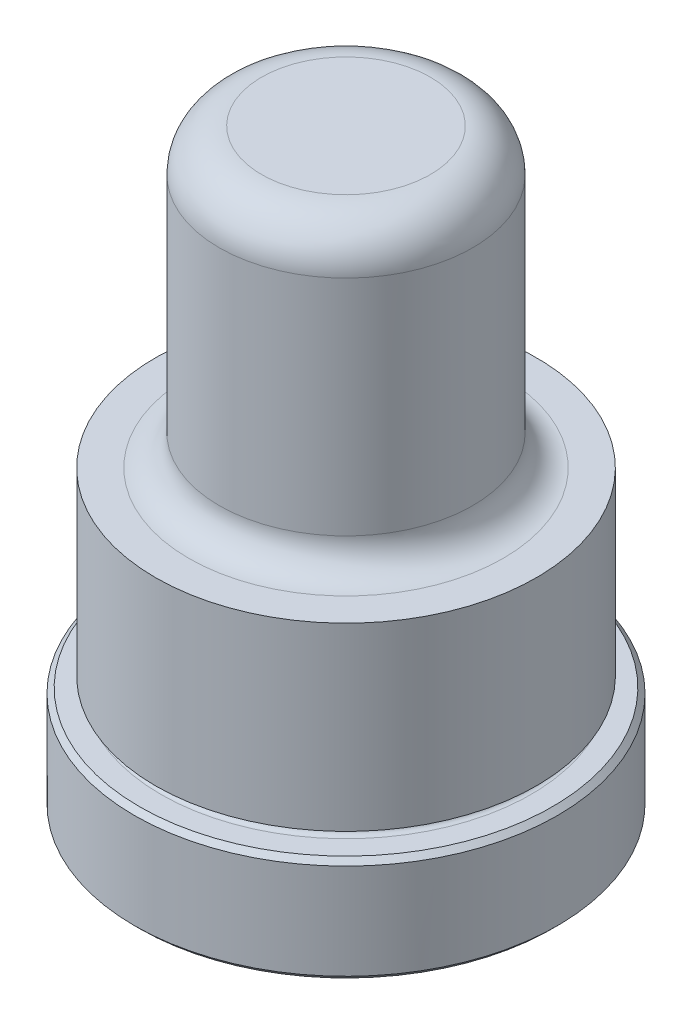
ISO-10303-21;
HEADER;
FILE_DESCRIPTION(('STEP AP214'),'2;1');
FILE_NAME('part.step','',(''),(''),'','','');
FILE_SCHEMA(('AUTOMOTIVE_DESIGN { 1 0 10303 214 1 1 1 1 }'));
ENDSEC;
DATA;
#1=APPLICATION_CONTEXT('core data for automotive mechanical design processes');
#2=APPLICATION_PROTOCOL_DEFINITION('international standard','automotive_design',2000,#1);
#3=PRODUCT_CONTEXT('',#1,'mechanical');
#4=PRODUCT('Part','Part','',(#3));
#5=PRODUCT_RELATED_PRODUCT_CATEGORY('part','',(#4));
#6=PRODUCT_DEFINITION_FORMATION('','',#4);
#7=PRODUCT_DEFINITION_CONTEXT('part definition',#1,'design');
#8=PRODUCT_DEFINITION('design','',#6,#7);
#9=PRODUCT_DEFINITION_SHAPE('','',#8);
#10=(LENGTH_UNIT() NAMED_UNIT(*) SI_UNIT(.MILLI.,.METRE.));
#11=(NAMED_UNIT(*) PLANE_ANGLE_UNIT() SI_UNIT($,.RADIAN.));
#12=(NAMED_UNIT(*) SI_UNIT($,.STERADIAN.) SOLID_ANGLE_UNIT());
#13=UNCERTAINTY_MEASURE_WITH_UNIT(LENGTH_MEASURE(1.E-05),#10,'distance_accuracy_value','');
#14=(GEOMETRIC_REPRESENTATION_CONTEXT(3) GLOBAL_UNCERTAINTY_ASSIGNED_CONTEXT((#13)) GLOBAL_UNIT_ASSIGNED_CONTEXT((#10,
#11,#12)) REPRESENTATION_CONTEXT('',''));
#15=CARTESIAN_POINT('',(0.,0.,0.));
#16=DIRECTION('',(0.,0.,1.));
#17=DIRECTION('',(1.,0.,0.));
#18=AXIS2_PLACEMENT_3D('',#15,#16,#17);
#19=CARTESIAN_POINT('',(0.,0.,0.));
#20=DIRECTION('',(0.,1.,0.));
#21=DIRECTION('',(0.,0.,1.));
#22=AXIS2_PLACEMENT_3D('',#19,#20,#21);
#23=PLANE('',#22);
#24=CARTESIAN_POINT('',(0.,0.,0.));
#25=DIRECTION('',(0.,1.,0.));
#26=DIRECTION('',(0.,0.,1.));
#27=AXIS2_PLACEMENT_3D('',#24,#25,#26);
#28=CIRCLE('',#27,15.494);
#29=CARTESIAN_POINT('',(0.,0.,15.494));
#30=VERTEX_POINT('',#29);
#31=EDGE_CURVE('E46',#30,#30,#28,.F.);
#32=ORIENTED_EDGE('',*,*,#31,.T.);
#33=EDGE_LOOP('',(#32));
#34=FACE_BOUND('',#33,.T.);
#35=ADVANCED_FACE('F31',(#34),#23,.F.);
#36=CARTESIAN_POINT('',(0.,0.,0.));
#37=DIRECTION('',(0.,1.,0.));
#38=DIRECTION('',(0.,0.,1.));
#39=AXIS2_PLACEMENT_3D('',#36,#37,#38);
#40=CYLINDRICAL_SURFACE('',#39,15.875);
#41=CARTESIAN_POINT('',(0.,0.380999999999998,0.));
#42=DIRECTION('',(0.,1.,0.));
#43=DIRECTION('',(0.,0.,1.));
#44=AXIS2_PLACEMENT_3D('',#41,#42,#43);
#45=CIRCLE('',#44,15.875);
#46=CARTESIAN_POINT('',(0.,0.380999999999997,15.875));
#47=VERTEX_POINT('',#46);
#48=EDGE_CURVE('E51',#47,#47,#45,.T.);
#49=ORIENTED_EDGE('',*,*,#48,.T.);
#50=EDGE_LOOP('',(#49));
#51=FACE_BOUND('',#50,.T.);
#52=CARTESIAN_POINT('',(0.,7.54379999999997,0.));
#53=DIRECTION('',(0.,-1.,0.));
#54=DIRECTION('',(0.,0.,-1.));
#55=AXIS2_PLACEMENT_3D('',#52,#53,#54);
#56=CIRCLE('',#55,15.875);
#57=CARTESIAN_POINT('',(0.,7.54379999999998,-15.875));
#58=VERTEX_POINT('',#57);
#59=EDGE_CURVE('E54',#58,#58,#56,.T.);
#60=ORIENTED_EDGE('',*,*,#59,.T.);
#61=EDGE_LOOP('',(#60));
#62=FACE_BOUND('',#61,.T.);
#63=ADVANCED_FACE('F110',(#51,#62),#40,.T.);
#64=CARTESIAN_POINT('',(0.,7.9248,-15.875));
#65=DIRECTION('',(0.,-1.,0.));
#66=DIRECTION('',(0.,0.,-1.));
#67=AXIS2_PLACEMENT_3D('',#64,#65,#66);
#68=PLANE('',#67);
#69=CARTESIAN_POINT('',(0.,7.9248,0.));
#70=DIRECTION('',(0.,-1.,0.));
#71=DIRECTION('',(0.,0.,-1.));
#72=AXIS2_PLACEMENT_3D('',#69,#70,#71);
#73=CIRCLE('',#72,15.494);
#74=CARTESIAN_POINT('',(0.,7.9248,-15.494));
#75=VERTEX_POINT('',#74);
#76=EDGE_CURVE('E42',#75,#75,#73,.F.);
#77=ORIENTED_EDGE('',*,*,#76,.T.);
#78=EDGE_LOOP('',(#77));
#79=FACE_BOUND('',#78,.T.);
#80=CARTESIAN_POINT('',(0.,7.9248,0.));
#81=DIRECTION('',(0.,1.,0.));
#82=DIRECTION('',(0.,0.,1.));
#83=AXIS2_PLACEMENT_3D('',#80,#81,#82);
#84=CIRCLE('',#83,13.8938);
#85=CARTESIAN_POINT('',(0.,7.9248,13.8938));
#86=VERTEX_POINT('',#85);
#87=EDGE_CURVE('E57',#86,#86,#84,.T.);
#88=ORIENTED_EDGE('',*,*,#87,.F.);
#89=EDGE_LOOP('',(#88));
#90=FACE_BOUND('',#89,.T.);
#91=ADVANCED_FACE('F105',(#79,#90),#68,.F.);
#92=CARTESIAN_POINT('',(0.,8.3058,0.));
#93=DIRECTION('',(0.,1.,0.));
#94=DIRECTION('',(0.,0.,1.));
#95=AXIS2_PLACEMENT_3D('',#92,#93,#94);
#96=TOROIDAL_SURFACE('',#95,13.8938,0.381000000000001);
#97=CARTESIAN_POINT('',(0.,8.68680000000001,0.));
#98=DIRECTION('',(0.,1.,0.));
#99=DIRECTION('',(0.,0.,1.));
#100=AXIS2_PLACEMENT_3D('',#97,#98,#99);
#101=CIRCLE('',#100,13.8938);
#102=CARTESIAN_POINT('',(0.,8.6868,13.8938));
#103=VERTEX_POINT('',#102);
#104=EDGE_CURVE('E60',#103,#103,#101,.T.);
#105=ORIENTED_EDGE('',*,*,#104,.F.);
#106=EDGE_LOOP('',(#105));
#107=FACE_BOUND('',#106,.T.);
#108=ORIENTED_EDGE('',*,*,#87,.T.);
#109=EDGE_LOOP('',(#108));
#110=FACE_BOUND('',#109,.T.);
#111=ADVANCED_FACE('F99',(#107,#110),#96,.F.);
#112=CARTESIAN_POINT('',(0.,8.68680000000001,-13.8938));
#113=DIRECTION('',(0.,1.,0.));
#114=DIRECTION('',(0.,0.,1.));
#115=AXIS2_PLACEMENT_3D('',#112,#113,#114);
#116=PLANE('',#115);
#117=CARTESIAN_POINT('',(0.,8.6868,0.));
#118=DIRECTION('',(0.,1.,0.));
#119=DIRECTION('',(0.,0.,1.));
#120=AXIS2_PLACEMENT_3D('',#117,#118,#119);
#121=CIRCLE('',#120,14.3002);
#122=CARTESIAN_POINT('',(0.,8.6868,14.3002));
#123=VERTEX_POINT('',#122);
#124=EDGE_CURVE('E63',#123,#123,#121,.T.);
#125=ORIENTED_EDGE('',*,*,#124,.F.);
#126=EDGE_LOOP('',(#125));
#127=FACE_BOUND('',#126,.T.);
#128=ORIENTED_EDGE('',*,*,#104,.T.);
#129=EDGE_LOOP('',(#128));
#130=FACE_BOUND('',#129,.T.);
#131=ADVANCED_FACE('F93',(#127,#130),#116,.F.);
#132=CARTESIAN_POINT('',(0.,0.,0.));
#133=DIRECTION('',(0.,1.,0.));
#134=DIRECTION('',(0.,0.,1.));
#135=AXIS2_PLACEMENT_3D('',#132,#133,#134);
#136=CYLINDRICAL_SURFACE('',#135,14.3002);
#137=CARTESIAN_POINT('',(0.,22.225,0.));
#138=DIRECTION('',(0.,1.,0.));
#139=DIRECTION('',(0.,0.,1.));
#140=AXIS2_PLACEMENT_3D('',#137,#138,#139);
#141=CIRCLE('',#140,14.3002);
#142=CARTESIAN_POINT('',(0.,22.225,14.3002));
#143=VERTEX_POINT('',#142);
#144=EDGE_CURVE('E66',#143,#143,#141,.T.);
#145=ORIENTED_EDGE('',*,*,#144,.F.);
#146=EDGE_LOOP('',(#145));
#147=FACE_BOUND('',#146,.T.);
#148=ORIENTED_EDGE('',*,*,#124,.T.);
#149=EDGE_LOOP('',(#148));
#150=FACE_BOUND('',#149,.T.);
#151=ADVANCED_FACE('F87',(#147,#150),#136,.T.);
#152=CARTESIAN_POINT('',(0.,22.225,-14.3002));
#153=DIRECTION('',(0.,-1.,0.));
#154=DIRECTION('',(0.,0.,-1.));
#155=AXIS2_PLACEMENT_3D('',#152,#153,#154);
#156=PLANE('',#155);
#157=CARTESIAN_POINT('',(0.,22.225,0.));
#158=DIRECTION('',(0.,1.,0.));
#159=DIRECTION('',(0.,0.,1.));
#160=AXIS2_PLACEMENT_3D('',#157,#158,#159);
#161=CIRCLE('',#160,11.7983);
#162=CARTESIAN_POINT('',(0.,22.225,11.7983));
#163=VERTEX_POINT('',#162);
#164=EDGE_CURVE('E69',#163,#163,#161,.T.);
#165=ORIENTED_EDGE('',*,*,#164,.F.);
#166=EDGE_LOOP('',(#165));
#167=FACE_BOUND('',#166,.T.);
#168=ORIENTED_EDGE('',*,*,#144,.T.);
#169=EDGE_LOOP('',(#168));
#170=FACE_BOUND('',#169,.T.);
#171=ADVANCED_FACE('F81',(#167,#170),#156,.F.);
#172=CARTESIAN_POINT('',(0.,24.511,0.));
#173=DIRECTION('',(0.,1.,0.));
#174=DIRECTION('',(0.,0.,1.));
#175=AXIS2_PLACEMENT_3D('',#172,#173,#174);
#176=TOROIDAL_SURFACE('',#175,11.7983,2.286);
#177=CARTESIAN_POINT('',(0.,24.511,0.));
#178=DIRECTION('',(0.,1.,0.));
#179=DIRECTION('',(0.,0.,1.));
#180=AXIS2_PLACEMENT_3D('',#177,#178,#179);
#181=CIRCLE('',#180,9.51229999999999);
#182=CARTESIAN_POINT('',(0.,24.511,9.5123));
#183=VERTEX_POINT('',#182);
#184=EDGE_CURVE('E72',#183,#183,#181,.T.);
#185=ORIENTED_EDGE('',*,*,#184,.F.);
#186=EDGE_LOOP('',(#185));
#187=FACE_BOUND('',#186,.T.);
#188=ORIENTED_EDGE('',*,*,#164,.T.);
#189=EDGE_LOOP('',(#188));
#190=FACE_BOUND('',#189,.T.);
#191=ADVANCED_FACE('F78',(#187,#190),#176,.F.);
#192=CARTESIAN_POINT('',(0.,0.,0.));
#193=DIRECTION('',(0.,1.,0.));
#194=DIRECTION('',(0.,0.,1.));
#195=AXIS2_PLACEMENT_3D('',#192,#193,#194);
#196=CYLINDRICAL_SURFACE('',#195,9.51229999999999);
#197=CARTESIAN_POINT('',(0.,41.275,0.));
#198=DIRECTION('',(0.,-1.,0.));
#199=DIRECTION('',(0.,0.,-1.));
#200=AXIS2_PLACEMENT_3D('',#197,#198,#199);
#201=CIRCLE('',#200,9.51229999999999);
#202=CARTESIAN_POINT('',(0.,41.275,-9.51229999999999));
#203=VERTEX_POINT('',#202);
#204=EDGE_CURVE('E10',#203,#203,#201,.T.);
#205=ORIENTED_EDGE('',*,*,#204,.T.);
#206=EDGE_LOOP('',(#205));
#207=FACE_BOUND('',#206,.T.);
#208=ORIENTED_EDGE('',*,*,#184,.T.);
#209=EDGE_LOOP('',(#208));
#210=FACE_BOUND('',#209,.T.);
#211=ADVANCED_FACE('F76',(#207,#210),#196,.T.);
#212=CARTESIAN_POINT('',(0.,44.45,-9.51229999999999));
#213=DIRECTION('',(0.,-1.,0.));
#214=DIRECTION('',(0.,0.,-1.));
#215=AXIS2_PLACEMENT_3D('',#212,#213,#214);
#216=PLANE('',#215);
#217=CARTESIAN_POINT('',(0.,44.45,0.));
#218=DIRECTION('',(0.,-1.,0.));
#219=DIRECTION('',(0.,0.,-1.));
#220=AXIS2_PLACEMENT_3D('',#217,#218,#219);
#221=CIRCLE('',#220,6.33729999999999);
#222=CARTESIAN_POINT('',(0.,44.45,-6.33729999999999));
#223=VERTEX_POINT('',#222);
#224=EDGE_CURVE('E38',#223,#223,#221,.F.);
#225=ORIENTED_EDGE('',*,*,#224,.T.);
#226=EDGE_LOOP('',(#225));
#227=FACE_BOUND('',#226,.T.);
#228=ADVANCED_FACE('F127',(#227),#216,.F.);
#229=CARTESIAN_POINT('',(0.,0.380999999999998,0.));
#230=DIRECTION('',(0.,1.,0.));
#231=DIRECTION('',(0.,0.,1.));
#232=AXIS2_PLACEMENT_3D('',#229,#230,#231);
#233=CONICAL_SURFACE('',#232,15.875,0.785398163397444);
#234=CARTESIAN_POINT('',(0.,0.,15.494));
#235=CARTESIAN_POINT('',(0.,0.00396874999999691,15.49796875));
#236=CARTESIAN_POINT('',(0.,0.00793749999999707,15.5019375));
#237=CARTESIAN_POINT('',(0.,0.0158749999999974,15.509875));
#238=CARTESIAN_POINT('',(0.,0.0198437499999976,15.51384375));
#239=CARTESIAN_POINT('',(0.,0.0277812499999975,15.52178125));
#240=CARTESIAN_POINT('',(0.,0.0317499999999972,15.52575));
#241=CARTESIAN_POINT('',(0.,0.0396874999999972,15.5336875));
#242=CARTESIAN_POINT('',(0.,0.0436562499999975,15.53765625));
#243=CARTESIAN_POINT('',(0.,0.0515937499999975,15.54559375));
#244=CARTESIAN_POINT('',(0.,0.0555624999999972,15.5495625));
#245=CARTESIAN_POINT('',(0.,0.0634999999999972,15.5575));
#246=CARTESIAN_POINT('',(0.,0.0674687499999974,15.56146875));
#247=CARTESIAN_POINT('',(0.,0.0754062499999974,15.56940625));
#248=CARTESIAN_POINT('',(0.,0.0793749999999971,15.573375));
#249=CARTESIAN_POINT('',(0.,0.0873124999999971,15.5813125));
#250=CARTESIAN_POINT('',(0.,0.0912812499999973,15.58528125));
#251=CARTESIAN_POINT('',(0.,0.0992187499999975,15.59321875));
#252=CARTESIAN_POINT('',(0.,0.103187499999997,15.5971875));
#253=CARTESIAN_POINT('',(0.,0.111124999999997,15.605125));
#254=CARTESIAN_POINT('',(0.,0.115093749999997,15.60909375));
#255=CARTESIAN_POINT('',(0.,0.123031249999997,15.61703125));
#256=CARTESIAN_POINT('',(0.,0.126999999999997,15.621));
#257=CARTESIAN_POINT('',(0.,0.134937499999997,15.6289375));
#258=CARTESIAN_POINT('',(0.,0.138906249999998,15.63290625));
#259=CARTESIAN_POINT('',(0.,0.146843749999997,15.64084375));
#260=CARTESIAN_POINT('',(0.,0.150812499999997,15.6448125));
#261=CARTESIAN_POINT('',(0.,0.158749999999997,15.65275));
#262=CARTESIAN_POINT('',(0.,0.162718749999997,15.65671875));
#263=CARTESIAN_POINT('',(0.,0.170656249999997,15.66465625));
#264=CARTESIAN_POINT('',(0.,0.174624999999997,15.668625));
#265=CARTESIAN_POINT('',(0.,0.182562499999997,15.6765625));
#266=CARTESIAN_POINT('',(0.,0.186531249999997,15.68053125));
#267=CARTESIAN_POINT('',(0.,0.194468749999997,15.68846875));
#268=CARTESIAN_POINT('',(0.,0.198437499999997,15.6924375));
#269=CARTESIAN_POINT('',(0.,0.206374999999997,15.700375));
#270=CARTESIAN_POINT('',(0.,0.210343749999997,15.70434375));
#271=CARTESIAN_POINT('',(0.,0.218281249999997,15.71228125));
#272=CARTESIAN_POINT('',(0.,0.222249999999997,15.71625));
#273=CARTESIAN_POINT('',(0.,0.230187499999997,15.7241875));
#274=CARTESIAN_POINT('',(0.,0.234156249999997,15.72815625));
#275=CARTESIAN_POINT('',(0.,0.242093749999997,15.73609375));
#276=CARTESIAN_POINT('',(0.,0.246062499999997,15.7400625));
#277=CARTESIAN_POINT('',(0.,0.253999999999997,15.748));
#278=CARTESIAN_POINT('',(0.,0.257968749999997,15.75196875));
#279=CARTESIAN_POINT('',(0.,0.265906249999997,15.75990625));
#280=CARTESIAN_POINT('',(0.,0.269874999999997,15.763875));
#281=CARTESIAN_POINT('',(0.,0.277812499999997,15.7718125));
#282=CARTESIAN_POINT('',(0.,0.281781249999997,15.77578125));
#283=CARTESIAN_POINT('',(0.,0.289718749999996,15.78371875));
#284=CARTESIAN_POINT('',(0.,0.293687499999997,15.7876875));
#285=CARTESIAN_POINT('',(0.,0.301624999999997,15.795625));
#286=CARTESIAN_POINT('',(0.,0.305593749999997,15.79959375));
#287=CARTESIAN_POINT('',(0.,0.313531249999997,15.80753125));
#288=CARTESIAN_POINT('',(0.,0.317499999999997,15.8115));
#289=CARTESIAN_POINT('',(0.,0.325437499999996,15.8194375));
#290=CARTESIAN_POINT('',(0.,0.329406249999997,15.82340625));
#291=CARTESIAN_POINT('',(0.,0.337343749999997,15.83134375));
#292=CARTESIAN_POINT('',(0.,0.341312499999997,15.8353125));
#293=CARTESIAN_POINT('',(0.,0.349249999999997,15.84325));
#294=CARTESIAN_POINT('',(0.,0.353218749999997,15.84721875));
#295=CARTESIAN_POINT('',(0.,0.361156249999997,15.85515625));
#296=CARTESIAN_POINT('',(0.,0.365124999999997,15.859125));
#297=CARTESIAN_POINT('',(0.,0.373062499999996,15.8670625));
#298=CARTESIAN_POINT('',(0.,0.377031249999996,15.87103125));
#299=CARTESIAN_POINT('',(0.,0.380999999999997,15.875));
#300=B_SPLINE_CURVE_WITH_KNOTS('',3,(#234,#235,#236,#237,#238,#239,#240,#241,#242,#243,#244,
#245,#246,#247,#248,#249,#250,#251,#252,#253,#254,#255,#256,#257,#258,#259,#260,#261,#262,#263,
#264,#265,#266,#267,#268,#269,#270,#271,#272,#273,#274,#275,#276,#277,#278,#279,#280,#281,#282,
#283,#284,#285,#286,#287,#288,#289,#290,#291,#292,#293,#294,#295,#296,#297,#298,#299),
.UNSPECIFIED.,.F.,.F.,(4,2,2,2,2,2,2,2,2,2,2,2,2,2,2,2,2,2,2,2,2,2,2,2,2,2,2,2,2,2,2,2,4),(0.,
0.0168379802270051,0.033675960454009,0.0505139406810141,0.0673519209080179,0.084189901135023,
0.101027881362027,0.117865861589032,0.134703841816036,0.151541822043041,0.168379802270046,
0.18521778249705,0.202055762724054,0.21889374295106,0.235731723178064,0.252569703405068,
0.269407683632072,0.286245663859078,0.303083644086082,0.319921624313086,0.336759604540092,
0.353597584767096,0.3704355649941,0.387273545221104,0.40411152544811,0.420949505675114,
0.437787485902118,0.454625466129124,0.471463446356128,0.488301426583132,0.505139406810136,
0.521977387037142,0.538815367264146),.UNSPECIFIED.);
#301=EDGE_CURVE('BSEAM124',#30,#47,#300,.T.);
#302=ORIENTED_EDGE('',*,*,#31,.F.);
#303=ORIENTED_EDGE('',*,*,#48,.F.);
#304=ORIENTED_EDGE('',*,*,#301,.T.);
#305=ORIENTED_EDGE('',*,*,#301,.F.);
#306=EDGE_LOOP('',(#302,#304,#303,#305));
#307=FACE_BOUND('',#306,.T.);
#308=ADVANCED_FACE('F124',(#307),#233,.T.);
#309=CARTESIAN_POINT('',(0.,7.9248,0.));
#310=DIRECTION('',(0.,-1.,0.));
#311=DIRECTION('',(0.,0.,-1.));
#312=AXIS2_PLACEMENT_3D('',#309,#310,#311);
#313=CONICAL_SURFACE('',#312,15.494,0.785398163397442);
#314=ORIENTED_EDGE('',*,*,#59,.F.);
#315=EDGE_LOOP('',(#314));
#316=FACE_BOUND('',#315,.T.);
#317=ORIENTED_EDGE('',*,*,#76,.F.);
#318=EDGE_LOOP('',(#317));
#319=FACE_BOUND('',#318,.T.);
#320=ADVANCED_FACE('F126',(#316,#319),#313,.T.);
#321=CARTESIAN_POINT('',(0.,41.275,0.));
#322=DIRECTION('',(0.,-1.,0.));
#323=DIRECTION('',(0.,0.,-1.));
#324=AXIS2_PLACEMENT_3D('',#321,#322,#323);
#325=TOROIDAL_SURFACE('',#324,6.33729999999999,3.175);
#326=ORIENTED_EDGE('',*,*,#204,.F.);
#327=EDGE_LOOP('',(#326));
#328=FACE_BOUND('',#327,.T.);
#329=ORIENTED_EDGE('',*,*,#224,.F.);
#330=EDGE_LOOP('',(#329));
#331=FACE_BOUND('',#330,.T.);
#332=ADVANCED_FACE('F33',(#328,#331),#325,.T.);
#333=CLOSED_SHELL('',(#35,#63,#91,#111,#131,#151,#171,#191,#211,#228,#308,#320,#332));
#334=MANIFOLD_SOLID_BREP('B2',#333);
#335=ADVANCED_BREP_SHAPE_REPRESENTATION('',(#18,#334),#14);
#336=SHAPE_DEFINITION_REPRESENTATION(#9,#335);
ENDSEC;
END-ISO-10303-21;
